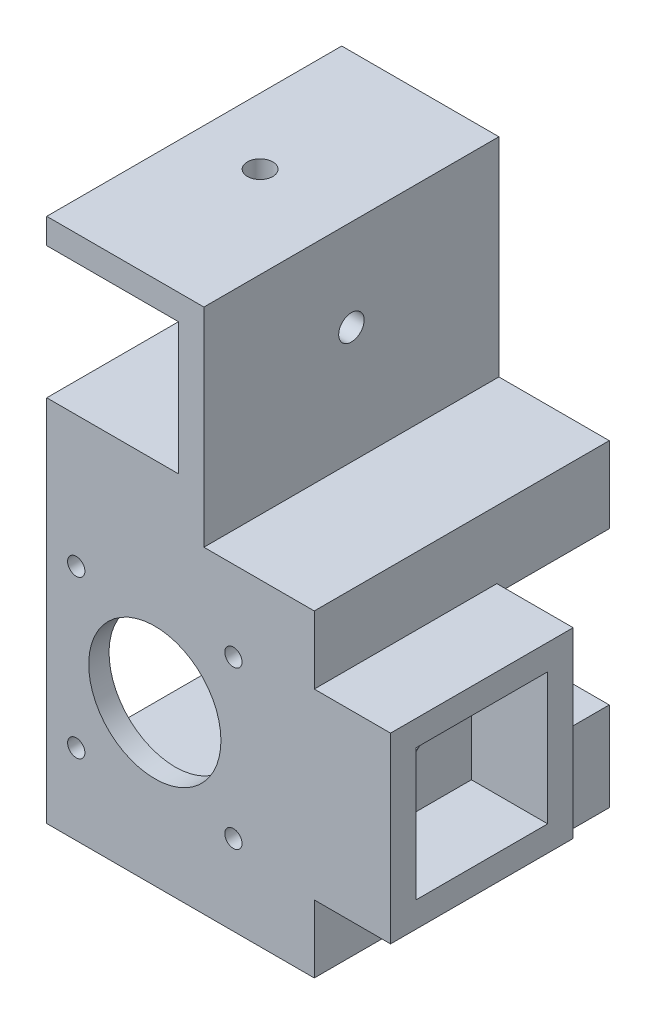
ISO-10303-21;
HEADER;
FILE_DESCRIPTION(('STEP AP214'),'2;1');
FILE_NAME('part.step','',(''),(''),'','','');
FILE_SCHEMA(('AUTOMOTIVE_DESIGN { 1 0 10303 214 1 1 1 1 }'));
ENDSEC;
DATA;
#1=APPLICATION_CONTEXT('core data for automotive mechanical design processes');
#2=APPLICATION_PROTOCOL_DEFINITION('international standard','automotive_design',2000,#1);
#3=PRODUCT_CONTEXT('',#1,'mechanical');
#4=PRODUCT('Part','Part','',(#3));
#5=PRODUCT_RELATED_PRODUCT_CATEGORY('part','',(#4));
#6=PRODUCT_DEFINITION_FORMATION('','',#4);
#7=PRODUCT_DEFINITION_CONTEXT('part definition',#1,'design');
#8=PRODUCT_DEFINITION('design','',#6,#7);
#9=PRODUCT_DEFINITION_SHAPE('','',#8);
#10=(LENGTH_UNIT() NAMED_UNIT(*) SI_UNIT(.MILLI.,.METRE.));
#11=(NAMED_UNIT(*) PLANE_ANGLE_UNIT() SI_UNIT($,.RADIAN.));
#12=(NAMED_UNIT(*) SI_UNIT($,.STERADIAN.) SOLID_ANGLE_UNIT());
#13=UNCERTAINTY_MEASURE_WITH_UNIT(LENGTH_MEASURE(1.E-05),#10,'distance_accuracy_value','');
#14=(GEOMETRIC_REPRESENTATION_CONTEXT(3) GLOBAL_UNCERTAINTY_ASSIGNED_CONTEXT((#13)) GLOBAL_UNIT_ASSIGNED_CONTEXT((#10,
#11,#12)) REPRESENTATION_CONTEXT('',''));
#15=CARTESIAN_POINT('',(0.,0.,0.));
#16=DIRECTION('',(0.,0.,1.));
#17=DIRECTION('',(1.,0.,0.));
#18=AXIS2_PLACEMENT_3D('',#15,#16,#17);
#19=CARTESIAN_POINT('',(31.35,0.,0.));
#20=DIRECTION('',(-1.,0.,0.));
#21=DIRECTION('',(0.,0.,1.));
#22=AXIS2_PLACEMENT_3D('',#19,#20,#21);
#23=PLANE('',#22);
#24=DIRECTION('',(0.,1.,0.));
#25=VECTOR('',#24,1.);
#26=CARTESIAN_POINT('',(31.35,-17.95,-25.9));
#27=LINE('',#26,#25);
#28=CARTESIAN_POINT('',(31.35,16.25,-25.9));
#29=VERTEX_POINT('',#28);
#30=CARTESIAN_POINT('',(31.35,17.95,-25.9));
#31=VERTEX_POINT('',#30);
#32=EDGE_CURVE('E396',#29,#31,#27,.T.);
#33=ORIENTED_EDGE('',*,*,#32,.F.);
#34=DIRECTION('',(0.,0.,1.));
#35=VECTOR('',#34,1.);
#36=CARTESIAN_POINT('',(31.35,16.25,-25.9));
#37=LINE('',#36,#35);
#38=CARTESIAN_POINT('',(31.35,16.25,-48.));
#39=VERTEX_POINT('',#38);
#40=EDGE_CURVE('E315',#39,#29,#37,.T.);
#41=ORIENTED_EDGE('',*,*,#40,.F.);
#42=DIRECTION('',(0.,1.,0.));
#43=VECTOR('',#42,1.);
#44=CARTESIAN_POINT('',(31.35,-31.25,-48.));
#45=LINE('',#44,#43);
#46=CARTESIAN_POINT('',(31.35,31.25,-48.));
#47=VERTEX_POINT('',#46);
#48=EDGE_CURVE('E414',#39,#47,#45,.T.);
#49=ORIENTED_EDGE('',*,*,#48,.T.);
#50=DIRECTION('',(0.,0.,1.));
#51=VECTOR('',#50,1.);
#52=CARTESIAN_POINT('',(31.35,31.25,9.99999999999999));
#53=LINE('',#52,#51);
#54=CARTESIAN_POINT('',(31.35,31.25,9.99999999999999));
#55=VERTEX_POINT('',#54);
#56=EDGE_CURVE('E418',#47,#55,#53,.T.);
#57=ORIENTED_EDGE('',*,*,#56,.T.);
#58=DIRECTION('',(0.,-1.,0.));
#59=VECTOR('',#58,1.);
#60=CARTESIAN_POINT('',(31.35,-31.25,9.99999999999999));
#61=LINE('',#60,#59);
#62=CARTESIAN_POINT('',(31.35,17.95,9.99999999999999));
#63=VERTEX_POINT('',#62);
#64=EDGE_CURVE('E422',#55,#63,#61,.T.);
#65=ORIENTED_EDGE('',*,*,#64,.T.);
#66=DIRECTION('',(0.,0.,1.));
#67=VECTOR('',#66,1.);
#68=CARTESIAN_POINT('',(31.35,17.95,9.99999999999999));
#69=LINE('',#68,#67);
#70=EDGE_CURVE('E400',#31,#63,#69,.T.);
#71=ORIENTED_EDGE('',*,*,#70,.F.);
#72=EDGE_LOOP('',(#33,#41,#49,#57,#65,#71));
#73=FACE_BOUND('',#72,.T.);
#74=ADVANCED_FACE('F41',(#73),#23,.F.);
#75=CARTESIAN_POINT('',(0.,0.,-48.));
#76=DIRECTION('',(0.,0.,-1.));
#77=DIRECTION('',(-1.,0.,0.));
#78=AXIS2_PLACEMENT_3D('',#75,#76,#77);
#79=PLANE('',#78);
#80=DIRECTION('',(1.,0.,0.));
#81=VECTOR('',#80,1.);
#82=CARTESIAN_POINT('',(9.65,72.15,-48.));
#83=LINE('',#82,#81);
#84=CARTESIAN_POINT('',(-21.25,72.15,-48.));
#85=VERTEX_POINT('',#84);
#86=CARTESIAN_POINT('',(9.65,72.15,-48.));
#87=VERTEX_POINT('',#86);
#88=EDGE_CURVE('E293',#85,#87,#83,.T.);
#89=ORIENTED_EDGE('',*,*,#88,.T.);
#90=DIRECTION('',(0.,-1.,0.));
#91=VECTOR('',#90,1.);
#92=CARTESIAN_POINT('',(9.64999999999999,77.15,-48.));
#93=LINE('',#92,#91);
#94=CARTESIAN_POINT('',(9.64999999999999,31.25,-48.));
#95=VERTEX_POINT('',#94);
#96=EDGE_CURVE('E350',#87,#95,#93,.T.);
#97=ORIENTED_EDGE('',*,*,#96,.T.);
#98=DIRECTION('',(-1.,0.,0.));
#99=VECTOR('',#98,1.);
#100=CARTESIAN_POINT('',(-31.25,31.25,-48.));
#101=LINE('',#100,#99);
#102=EDGE_CURVE('E226',#47,#95,#101,.T.);
#103=ORIENTED_EDGE('',*,*,#102,.F.);
#104=ORIENTED_EDGE('',*,*,#48,.F.);
#105=DIRECTION('',(1.,0.,0.));
#106=VECTOR('',#105,1.);
#107=CARTESIAN_POINT('',(-31.25,16.25,-48.));
#108=LINE('',#107,#106);
#109=CARTESIAN_POINT('',(21.25,16.25,-48.));
#110=VERTEX_POINT('',#109);
#111=EDGE_CURVE('E322',#110,#39,#108,.T.);
#112=ORIENTED_EDGE('',*,*,#111,.F.);
#113=DIRECTION('',(0.,1.,0.));
#114=VECTOR('',#113,1.);
#115=CARTESIAN_POINT('',(21.25,-21.25,-48.));
#116=LINE('',#115,#114);
#117=CARTESIAN_POINT('',(21.25,21.25,-48.));
#118=VERTEX_POINT('',#117);
#119=EDGE_CURVE('E436',#110,#118,#116,.T.);
#120=ORIENTED_EDGE('',*,*,#119,.T.);
#121=DIRECTION('',(-1.,0.,0.));
#122=VECTOR('',#121,1.);
#123=CARTESIAN_POINT('',(-21.25,21.25,-48.));
#124=LINE('',#123,#122);
#125=CARTESIAN_POINT('',(-21.25,21.25,-48.));
#126=VERTEX_POINT('',#125);
#127=EDGE_CURVE('E438',#118,#126,#124,.T.);
#128=ORIENTED_EDGE('',*,*,#127,.T.);
#129=DIRECTION('',(0.,1.,0.));
#130=VECTOR('',#129,1.);
#131=CARTESIAN_POINT('',(-21.25,72.15,-48.));
#132=LINE('',#131,#130);
#133=CARTESIAN_POINT('',(-21.25,41.25,-48.));
#134=VERTEX_POINT('',#133);
#135=EDGE_CURVE('E301',#126,#134,#132,.T.);
#136=ORIENTED_EDGE('',*,*,#135,.T.);
#137=DIRECTION('',(1.,0.,0.));
#138=VECTOR('',#137,1.);
#139=CARTESIAN_POINT('',(4.65,41.25,-48.));
#140=LINE('',#139,#138);
#141=CARTESIAN_POINT('',(4.65,41.25,-48.));
#142=VERTEX_POINT('',#141);
#143=EDGE_CURVE('E310',#134,#142,#140,.T.);
#144=ORIENTED_EDGE('',*,*,#143,.T.);
#145=DIRECTION('',(0.,1.,0.));
#146=VECTOR('',#145,1.);
#147=CARTESIAN_POINT('',(4.65,67.15,-48.));
#148=LINE('',#147,#146);
#149=CARTESIAN_POINT('',(4.65,67.15,-48.));
#150=VERTEX_POINT('',#149);
#151=EDGE_CURVE('E304',#142,#150,#148,.T.);
#152=ORIENTED_EDGE('',*,*,#151,.T.);
#153=DIRECTION('',(-1.,0.,0.));
#154=VECTOR('',#153,1.);
#155=CARTESIAN_POINT('',(4.65,67.15,-48.));
#156=LINE('',#155,#154);
#157=CARTESIAN_POINT('',(-21.25,67.15,-48.));
#158=VERTEX_POINT('',#157);
#159=EDGE_CURVE('E307',#150,#158,#156,.T.);
#160=ORIENTED_EDGE('',*,*,#159,.T.);
#161=EDGE_CURVE('E296',#158,#85,#132,.T.);
#162=ORIENTED_EDGE('',*,*,#161,.T.);
#163=EDGE_LOOP('',(#89,#97,#103,#104,#112,#120,#128,#136,#144,#152,#160,#162));
#164=FACE_BOUND('',#163,.T.);
#165=ADVANCED_FACE('F480',(#164),#79,.T.);
#166=CARTESIAN_POINT('',(21.35,0.,-7.95000000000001));
#167=DIRECTION('',(1.,0.,0.));
#168=DIRECTION('',(0.,0.,-1.));
#169=AXIS2_PLACEMENT_3D('',#166,#167,#168);
#170=CYLINDRICAL_SURFACE('',#169,3.43);
#171=CARTESIAN_POINT('',(31.35,0.,-7.95000000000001));
#172=DIRECTION('',(1.,0.,0.));
#173=DIRECTION('',(0.,0.,-1.));
#174=AXIS2_PLACEMENT_3D('',#171,#172,#173);
#175=CIRCLE('',#174,3.43);
#176=CARTESIAN_POINT('',(31.35,0.,-11.38));
#177=VERTEX_POINT('',#176);
#178=EDGE_CURVE('E373',#177,#177,#175,.T.);
#179=ORIENTED_EDGE('',*,*,#178,.T.);
#180=EDGE_LOOP('',(#179));
#181=FACE_BOUND('',#180,.T.);
#182=CARTESIAN_POINT('',(31.25,0.,-7.95000000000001));
#183=DIRECTION('',(-1.,0.,0.));
#184=DIRECTION('',(0.,0.,1.));
#185=AXIS2_PLACEMENT_3D('',#182,#183,#184);
#186=CIRCLE('',#185,3.43);
#187=CARTESIAN_POINT('',(31.25,0.,-4.52));
#188=VERTEX_POINT('',#187);
#189=EDGE_CURVE('E370',#188,#188,#186,.F.);
#190=ORIENTED_EDGE('',*,*,#189,.F.);
#191=EDGE_LOOP('',(#190));
#192=FACE_BOUND('',#191,.T.);
#193=ADVANCED_FACE('F490',(#181,#192),#170,.F.);
#194=CARTESIAN_POINT('',(31.35,-31.25,-48.));
#195=VERTEX_POINT('',#194);
#196=CARTESIAN_POINT('',(31.35,-13.75,-48.));
#197=VERTEX_POINT('',#196);
#198=EDGE_CURVE('E415',#195,#197,#45,.T.);
#199=ORIENTED_EDGE('',*,*,#198,.T.);
#200=DIRECTION('',(0.,0.,-1.));
#201=VECTOR('',#200,1.);
#202=CARTESIAN_POINT('',(31.35,-13.75,-25.9));
#203=LINE('',#202,#201);
#204=CARTESIAN_POINT('',(31.35,-13.75,-25.9));
#205=VERTEX_POINT('',#204);
#206=EDGE_CURVE('E313',#205,#197,#203,.T.);
#207=ORIENTED_EDGE('',*,*,#206,.F.);
#208=CARTESIAN_POINT('',(31.35,-17.95,-25.9));
#209=VERTEX_POINT('',#208);
#210=EDGE_CURVE('E397',#209,#205,#27,.T.);
#211=ORIENTED_EDGE('',*,*,#210,.F.);
#212=DIRECTION('',(0.,0.,-1.));
#213=VECTOR('',#212,1.);
#214=CARTESIAN_POINT('',(31.35,-17.95,9.99999999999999));
#215=LINE('',#214,#213);
#216=CARTESIAN_POINT('',(31.35,-17.95,9.99999999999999));
#217=VERTEX_POINT('',#216);
#218=EDGE_CURVE('E403',#217,#209,#215,.T.);
#219=ORIENTED_EDGE('',*,*,#218,.F.);
#220=CARTESIAN_POINT('',(31.35,-31.25,9.99999999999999));
#221=VERTEX_POINT('',#220);
#222=EDGE_CURVE('E421',#217,#221,#61,.T.);
#223=ORIENTED_EDGE('',*,*,#222,.T.);
#224=DIRECTION('',(0.,0.,-1.));
#225=VECTOR('',#224,1.);
#226=CARTESIAN_POINT('',(31.35,-31.25,9.99999999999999));
#227=LINE('',#226,#225);
#228=EDGE_CURVE('E425',#221,#195,#227,.T.);
#229=ORIENTED_EDGE('',*,*,#228,.T.);
#230=EDGE_LOOP('',(#199,#207,#211,#219,#223,#229));
#231=FACE_BOUND('',#230,.T.);
#232=ADVANCED_FACE('F483',(#231),#23,.F.);
#233=CARTESIAN_POINT('',(-31.25,-31.25,-48.));
#234=DIRECTION('',(0.,-1.,0.));
#235=DIRECTION('',(0.,0.,-1.));
#236=AXIS2_PLACEMENT_3D('',#233,#234,#235);
#237=PLANE('',#236);
#238=DIRECTION('',(0.,0.,1.));
#239=VECTOR('',#238,1.);
#240=CARTESIAN_POINT('',(-21.25,-31.25,-48.));
#241=LINE('',#240,#239);
#242=CARTESIAN_POINT('',(-21.25,-31.25,-48.));
#243=VERTEX_POINT('',#242);
#244=CARTESIAN_POINT('',(-21.25,-31.25,10.));
#245=VERTEX_POINT('',#244);
#246=EDGE_CURVE('E300',#243,#245,#241,.T.);
#247=ORIENTED_EDGE('',*,*,#246,.F.);
#248=DIRECTION('',(1.,0.,0.));
#249=VECTOR('',#248,1.);
#250=CARTESIAN_POINT('',(-31.25,-31.25,-48.));
#251=LINE('',#250,#249);
#252=EDGE_CURVE('E450',#243,#195,#251,.T.);
#253=ORIENTED_EDGE('',*,*,#252,.T.);
#254=ORIENTED_EDGE('',*,*,#228,.F.);
#255=DIRECTION('',(1.,0.,0.));
#256=VECTOR('',#255,1.);
#257=CARTESIAN_POINT('',(-31.25,-31.25,10.));
#258=LINE('',#257,#256);
#259=EDGE_CURVE('E434',#245,#221,#258,.T.);
#260=ORIENTED_EDGE('',*,*,#259,.F.);
#261=EDGE_LOOP('',(#247,#253,#254,#260));
#262=FACE_BOUND('',#261,.T.);
#263=ADVANCED_FACE('F497',(#262),#237,.T.);
#264=CARTESIAN_POINT('',(-31.25,31.25,-48.));
#265=DIRECTION('',(0.,1.,0.));
#266=DIRECTION('',(0.,0.,1.));
#267=AXIS2_PLACEMENT_3D('',#264,#265,#266);
#268=PLANE('',#267);
#269=DIRECTION('',(0.,0.,-1.));
#270=VECTOR('',#269,1.);
#271=CARTESIAN_POINT('',(9.64999999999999,31.25,-48.));
#272=LINE('',#271,#270);
#273=CARTESIAN_POINT('',(9.64999999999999,31.25,10.));
#274=VERTEX_POINT('',#273);
#275=EDGE_CURVE('E347',#274,#95,#272,.T.);
#276=ORIENTED_EDGE('',*,*,#275,.F.);
#277=DIRECTION('',(-1.,0.,0.));
#278=VECTOR('',#277,1.);
#279=CARTESIAN_POINT('',(-31.25,31.25,10.));
#280=LINE('',#279,#278);
#281=EDGE_CURVE('E431',#55,#274,#280,.T.);
#282=ORIENTED_EDGE('',*,*,#281,.F.);
#283=ORIENTED_EDGE('',*,*,#56,.F.);
#284=ORIENTED_EDGE('',*,*,#102,.T.);
#285=EDGE_LOOP('',(#276,#282,#283,#284));
#286=FACE_BOUND('',#285,.T.);
#287=ADVANCED_FACE('F43',(#286),#268,.T.);
#288=CARTESIAN_POINT('',(-21.25,-21.25,-48.));
#289=VERTEX_POINT('',#288);
#290=EDGE_CURVE('E297',#243,#289,#132,.T.);
#291=ORIENTED_EDGE('',*,*,#290,.T.);
#292=DIRECTION('',(1.,0.,0.));
#293=VECTOR('',#292,1.);
#294=CARTESIAN_POINT('',(-21.25,-21.25,-48.));
#295=LINE('',#294,#293);
#296=CARTESIAN_POINT('',(21.25,-21.25,-48.));
#297=VERTEX_POINT('',#296);
#298=EDGE_CURVE('E441',#289,#297,#295,.T.);
#299=ORIENTED_EDGE('',*,*,#298,.T.);
#300=CARTESIAN_POINT('',(21.25,-13.75,-48.));
#301=VERTEX_POINT('',#300);
#302=EDGE_CURVE('E222',#297,#301,#116,.T.);
#303=ORIENTED_EDGE('',*,*,#302,.T.);
#304=DIRECTION('',(1.,0.,0.));
#305=VECTOR('',#304,1.);
#306=CARTESIAN_POINT('',(-31.25,-13.75,-48.));
#307=LINE('',#306,#305);
#308=EDGE_CURVE('E324',#301,#197,#307,.T.);
#309=ORIENTED_EDGE('',*,*,#308,.T.);
#310=ORIENTED_EDGE('',*,*,#198,.F.);
#311=ORIENTED_EDGE('',*,*,#252,.F.);
#312=EDGE_LOOP('',(#291,#299,#303,#309,#310,#311));
#313=FACE_BOUND('',#312,.T.);
#314=ADVANCED_FACE('F493',(#313),#79,.T.);
#315=CARTESIAN_POINT('',(21.25,-21.25,-48.));
#316=DIRECTION('',(1.,0.,0.));
#317=DIRECTION('',(0.,0.,-1.));
#318=AXIS2_PLACEMENT_3D('',#315,#316,#317);
#319=PLANE('',#318);
#320=CARTESIAN_POINT('',(21.25,0.,-7.95000000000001));
#321=DIRECTION('',(-1.,0.,0.));
#322=DIRECTION('',(0.,0.,1.));
#323=AXIS2_PLACEMENT_3D('',#320,#321,#322);
#324=CIRCLE('',#323,7.);
#325=CARTESIAN_POINT('',(21.25,0.,-0.950000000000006));
#326=VERTEX_POINT('',#325);
#327=EDGE_CURVE('E366',#326,#326,#324,.T.);
#328=ORIENTED_EDGE('',*,*,#327,.F.);
#329=EDGE_LOOP('',(#328));
#330=FACE_BOUND('',#329,.T.);
#331=ORIENTED_EDGE('',*,*,#119,.F.);
#332=DIRECTION('',(0.,0.,1.));
#333=VECTOR('',#332,1.);
#334=CARTESIAN_POINT('',(21.25,16.25,-48.));
#335=LINE('',#334,#333);
#336=CARTESIAN_POINT('',(21.25,16.25,-25.9));
#337=VERTEX_POINT('',#336);
#338=EDGE_CURVE('E329',#110,#337,#335,.T.);
#339=ORIENTED_EDGE('',*,*,#338,.T.);
#340=DIRECTION('',(0.,-1.,0.));
#341=VECTOR('',#340,1.);
#342=CARTESIAN_POINT('',(21.25,-21.25,-25.9));
#343=LINE('',#342,#341);
#344=CARTESIAN_POINT('',(21.25,-13.75,-25.9));
#345=VERTEX_POINT('',#344);
#346=EDGE_CURVE('E332',#337,#345,#343,.T.);
#347=ORIENTED_EDGE('',*,*,#346,.T.);
#348=DIRECTION('',(0.,0.,-1.));
#349=VECTOR('',#348,1.);
#350=CARTESIAN_POINT('',(21.25,-13.75,-48.));
#351=LINE('',#350,#349);
#352=EDGE_CURVE('E321',#345,#301,#351,.T.);
#353=ORIENTED_EDGE('',*,*,#352,.T.);
#354=ORIENTED_EDGE('',*,*,#302,.F.);
#355=DIRECTION('',(0.,0.,1.));
#356=VECTOR('',#355,1.);
#357=CARTESIAN_POINT('',(21.25,-21.25,-48.));
#358=LINE('',#357,#356);
#359=CARTESIAN_POINT('',(21.25,-21.25,6.00000000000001));
#360=VERTEX_POINT('',#359);
#361=EDGE_CURVE('E213',#297,#360,#358,.T.);
#362=ORIENTED_EDGE('',*,*,#361,.T.);
#363=DIRECTION('',(0.,1.,0.));
#364=VECTOR('',#363,1.);
#365=CARTESIAN_POINT('',(21.25,21.25,6.));
#366=LINE('',#365,#364);
#367=CARTESIAN_POINT('',(21.25,21.25,6.));
#368=VERTEX_POINT('',#367);
#369=EDGE_CURVE('E219',#360,#368,#366,.T.);
#370=ORIENTED_EDGE('',*,*,#369,.T.);
#371=DIRECTION('',(0.,0.,1.));
#372=VECTOR('',#371,1.);
#373=CARTESIAN_POINT('',(21.25,21.25,-48.));
#374=LINE('',#373,#372);
#375=EDGE_CURVE('E442',#118,#368,#374,.T.);
#376=ORIENTED_EDGE('',*,*,#375,.F.);
#377=EDGE_LOOP('',(#331,#339,#347,#353,#354,#362,#370,#376));
#378=FACE_BOUND('',#377,.T.);
#379=ADVANCED_FACE('F216',(#330,#378),#319,.F.);
#380=CARTESIAN_POINT('',(-21.25,-21.25,-48.));
#381=DIRECTION('',(0.,-1.,0.));
#382=DIRECTION('',(0.,0.,-1.));
#383=AXIS2_PLACEMENT_3D('',#380,#381,#382);
#384=PLANE('',#383);
#385=DIRECTION('',(0.,0.,1.));
#386=VECTOR('',#385,1.);
#387=CARTESIAN_POINT('',(-21.25,-21.25,-48.));
#388=LINE('',#387,#386);
#389=CARTESIAN_POINT('',(-21.25,-21.25,6.00000000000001));
#390=VERTEX_POINT('',#389);
#391=EDGE_CURVE('E227',#289,#390,#388,.T.);
#392=ORIENTED_EDGE('',*,*,#391,.T.);
#393=DIRECTION('',(-1.,0.,0.));
#394=VECTOR('',#393,1.);
#395=CARTESIAN_POINT('',(21.25,-21.25,6.00000000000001));
#396=LINE('',#395,#394);
#397=EDGE_CURVE('E230',#360,#390,#396,.T.);
#398=ORIENTED_EDGE('',*,*,#397,.F.);
#399=ORIENTED_EDGE('',*,*,#361,.F.);
#400=ORIENTED_EDGE('',*,*,#298,.F.);
#401=EDGE_LOOP('',(#392,#398,#399,#400));
#402=FACE_BOUND('',#401,.T.);
#403=ADVANCED_FACE('F231',(#402),#384,.F.);
#404=CARTESIAN_POINT('',(-21.25,21.25,-48.));
#405=DIRECTION('',(0.,1.,0.));
#406=DIRECTION('',(0.,0.,1.));
#407=AXIS2_PLACEMENT_3D('',#404,#405,#406);
#408=PLANE('',#407);
#409=ORIENTED_EDGE('',*,*,#375,.T.);
#410=DIRECTION('',(-1.,0.,0.));
#411=VECTOR('',#410,1.);
#412=CARTESIAN_POINT('',(21.25,21.25,6.));
#413=LINE('',#412,#411);
#414=CARTESIAN_POINT('',(-21.25,21.25,6.));
#415=VERTEX_POINT('',#414);
#416=EDGE_CURVE('E235',#368,#415,#413,.T.);
#417=ORIENTED_EDGE('',*,*,#416,.T.);
#418=DIRECTION('',(0.,0.,1.));
#419=VECTOR('',#418,1.);
#420=CARTESIAN_POINT('',(-21.25,21.25,-48.));
#421=LINE('',#420,#419);
#422=EDGE_CURVE('E445',#126,#415,#421,.T.);
#423=ORIENTED_EDGE('',*,*,#422,.F.);
#424=ORIENTED_EDGE('',*,*,#127,.F.);
#425=EDGE_LOOP('',(#409,#417,#423,#424));
#426=FACE_BOUND('',#425,.T.);
#427=ADVANCED_FACE('F598',(#426),#408,.F.);
#428=CARTESIAN_POINT('',(0.,0.,10.));
#429=DIRECTION('',(0.,0.,-1.));
#430=DIRECTION('',(-1.,0.,0.));
#431=AXIS2_PLACEMENT_3D('',#428,#429,#430);
#432=PLANE('',#431);
#433=CARTESIAN_POINT('',(0.,0.,10.));
#434=DIRECTION('',(0.,0.,1.));
#435=DIRECTION('',(1.,0.,0.));
#436=AXIS2_PLACEMENT_3D('',#433,#434,#435);
#437=CIRCLE('',#436,13.);
#438=CARTESIAN_POINT('',(13.,0.,10.));
#439=VERTEX_POINT('',#438);
#440=EDGE_CURVE('E428',#439,#439,#437,.T.);
#441=ORIENTED_EDGE('',*,*,#440,.F.);
#442=EDGE_LOOP('',(#441));
#443=FACE_BOUND('',#442,.T.);
#444=CARTESIAN_POINT('',(15.45,-15.45,10.));
#445=DIRECTION('',(0.,0.,1.));
#446=DIRECTION('',(1.,0.,0.));
#447=AXIS2_PLACEMENT_3D('',#444,#445,#446);
#448=CIRCLE('',#447,1.7);
#449=CARTESIAN_POINT('',(17.15,-15.45,10.));
#450=VERTEX_POINT('',#449);
#451=EDGE_CURVE('E359',#450,#450,#448,.T.);
#452=ORIENTED_EDGE('',*,*,#451,.F.);
#453=EDGE_LOOP('',(#452));
#454=FACE_BOUND('',#453,.T.);
#455=CARTESIAN_POINT('',(15.45,15.45,10.));
#456=DIRECTION('',(0.,0.,1.));
#457=DIRECTION('',(1.,0.,0.));
#458=AXIS2_PLACEMENT_3D('',#455,#456,#457);
#459=CIRCLE('',#458,1.7);
#460=CARTESIAN_POINT('',(17.15,15.45,10.));
#461=VERTEX_POINT('',#460);
#462=EDGE_CURVE('E355',#461,#461,#459,.T.);
#463=ORIENTED_EDGE('',*,*,#462,.F.);
#464=EDGE_LOOP('',(#463));
#465=FACE_BOUND('',#464,.T.);
#466=DIRECTION('',(-1.,0.,0.));
#467=VECTOR('',#466,1.);
#468=CARTESIAN_POINT('',(51.35,-17.95,9.99999999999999));
#469=LINE('',#468,#467);
#470=CARTESIAN_POINT('',(46.35,-17.95,9.99999999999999));
#471=VERTEX_POINT('',#470);
#472=EDGE_CURVE('E408',#471,#217,#469,.T.);
#473=ORIENTED_EDGE('',*,*,#472,.F.);
#474=DIRECTION('',(0.,1.,0.));
#475=VECTOR('',#474,1.);
#476=CARTESIAN_POINT('',(46.35,-31.25,9.99999999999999));
#477=LINE('',#476,#475);
#478=CARTESIAN_POINT('',(46.35,17.95,9.99999999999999));
#479=VERTEX_POINT('',#478);
#480=EDGE_CURVE('E56',#471,#479,#477,.T.);
#481=ORIENTED_EDGE('',*,*,#480,.T.);
#482=DIRECTION('',(-1.,0.,0.));
#483=VECTOR('',#482,1.);
#484=CARTESIAN_POINT('',(51.35,17.95,9.99999999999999));
#485=LINE('',#484,#483);
#486=EDGE_CURVE('E410',#479,#63,#485,.T.);
#487=ORIENTED_EDGE('',*,*,#486,.T.);
#488=ORIENTED_EDGE('',*,*,#64,.F.);
#489=ORIENTED_EDGE('',*,*,#281,.T.);
#490=DIRECTION('',(0.,-1.,0.));
#491=VECTOR('',#490,1.);
#492=CARTESIAN_POINT('',(9.65,77.15,9.99999999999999));
#493=LINE('',#492,#491);
#494=CARTESIAN_POINT('',(9.65,72.15,9.99999999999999));
#495=VERTEX_POINT('',#494);
#496=EDGE_CURVE('E352',#495,#274,#493,.T.);
#497=ORIENTED_EDGE('',*,*,#496,.F.);
#498=DIRECTION('',(-1.,0.,0.));
#499=VECTOR('',#498,1.);
#500=CARTESIAN_POINT('',(-21.25,72.15,9.99999999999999));
#501=LINE('',#500,#499);
#502=CARTESIAN_POINT('',(-21.25,72.15,9.99999999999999));
#503=VERTEX_POINT('',#502);
#504=EDGE_CURVE('E281',#495,#503,#501,.T.);
#505=ORIENTED_EDGE('',*,*,#504,.T.);
#506=DIRECTION('',(0.,1.,0.));
#507=VECTOR('',#506,1.);
#508=CARTESIAN_POINT('',(-21.25,-31.25,9.99999999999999));
#509=LINE('',#508,#507);
#510=CARTESIAN_POINT('',(-21.25,67.15,9.99999999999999));
#511=VERTEX_POINT('',#510);
#512=EDGE_CURVE('E283',#511,#503,#509,.T.);
#513=ORIENTED_EDGE('',*,*,#512,.F.);
#514=DIRECTION('',(-1.,0.,0.));
#515=VECTOR('',#514,1.);
#516=CARTESIAN_POINT('',(0.,67.15,9.99999999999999));
#517=LINE('',#516,#515);
#518=CARTESIAN_POINT('',(4.65,67.15,9.99999999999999));
#519=VERTEX_POINT('',#518);
#520=EDGE_CURVE('E286',#519,#511,#517,.T.);
#521=ORIENTED_EDGE('',*,*,#520,.F.);
#522=DIRECTION('',(0.,1.,0.));
#523=VECTOR('',#522,1.);
#524=CARTESIAN_POINT('',(4.65,0.,9.99999999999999));
#525=LINE('',#524,#523);
#526=CARTESIAN_POINT('',(4.65,41.25,9.99999999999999));
#527=VERTEX_POINT('',#526);
#528=EDGE_CURVE('E49',#527,#519,#525,.T.);
#529=ORIENTED_EDGE('',*,*,#528,.F.);
#530=DIRECTION('',(-1.,0.,0.));
#531=VECTOR('',#530,1.);
#532=CARTESIAN_POINT('',(0.,41.25,9.99999999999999));
#533=LINE('',#532,#531);
#534=CARTESIAN_POINT('',(-21.25,41.25,9.99999999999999));
#535=VERTEX_POINT('',#534);
#536=EDGE_CURVE('E289',#527,#535,#533,.T.);
#537=ORIENTED_EDGE('',*,*,#536,.T.);
#538=DIRECTION('',(0.,1.,0.));
#539=VECTOR('',#538,1.);
#540=CARTESIAN_POINT('',(-21.25,72.15,10.));
#541=LINE('',#540,#539);
#542=EDGE_CURVE('E292',#245,#535,#541,.T.);
#543=ORIENTED_EDGE('',*,*,#542,.F.);
#544=ORIENTED_EDGE('',*,*,#259,.T.);
#545=ORIENTED_EDGE('',*,*,#222,.F.);
#546=EDGE_LOOP('',(#473,#481,#487,#488,#489,#497,#505,#513,#521,#529,#537,#543,#544,#545));
#547=FACE_BOUND('',#546,.T.);
#548=CARTESIAN_POINT('',(-15.45,15.45,10.));
#549=DIRECTION('',(0.,0.,1.));
#550=DIRECTION('',(1.,0.,0.));
#551=AXIS2_PLACEMENT_3D('',#548,#549,#550);
#552=CIRCLE('',#551,1.7);
#553=CARTESIAN_POINT('',(-13.75,15.45,10.));
#554=VERTEX_POINT('',#553);
#555=EDGE_CURVE('E358',#554,#554,#552,.T.);
#556=ORIENTED_EDGE('',*,*,#555,.F.);
#557=EDGE_LOOP('',(#556));
#558=FACE_BOUND('',#557,.T.);
#559=CARTESIAN_POINT('',(-15.45,-15.45,10.));
#560=DIRECTION('',(0.,0.,1.));
#561=DIRECTION('',(1.,0.,0.));
#562=AXIS2_PLACEMENT_3D('',#559,#560,#561);
#563=CIRCLE('',#562,1.7);
#564=CARTESIAN_POINT('',(-13.75,-15.45,10.));
#565=VERTEX_POINT('',#564);
#566=EDGE_CURVE('E354',#565,#565,#563,.T.);
#567=ORIENTED_EDGE('',*,*,#566,.F.);
#568=EDGE_LOOP('',(#567));
#569=FACE_BOUND('',#568,.T.);
#570=ADVANCED_FACE('F548',(#443,#454,#465,#547,#558,#569),#432,.F.);
#571=CARTESIAN_POINT('',(0.,0.,10.));
#572=DIRECTION('',(0.,0.,-1.));
#573=DIRECTION('',(-1.,0.,0.));
#574=AXIS2_PLACEMENT_3D('',#571,#572,#573);
#575=CYLINDRICAL_SURFACE('',#574,13.);
#576=CARTESIAN_POINT('',(0.,0.,6.));
#577=DIRECTION('',(0.,0.,1.));
#578=DIRECTION('',(0.,-1.,0.));
#579=AXIS2_PLACEMENT_3D('',#576,#577,#578);
#580=CIRCLE('',#579,13.);
#581=CARTESIAN_POINT('',(0.,-13.,6.));
#582=VERTEX_POINT('',#581);
#583=EDGE_CURVE('E258',#582,#582,#580,.T.);
#584=ORIENTED_EDGE('',*,*,#583,.F.);
#585=EDGE_LOOP('',(#584));
#586=FACE_BOUND('',#585,.T.);
#587=ORIENTED_EDGE('',*,*,#440,.T.);
#588=EDGE_LOOP('',(#587));
#589=FACE_BOUND('',#588,.T.);
#590=ADVANCED_FACE('F618',(#586,#589),#575,.F.);
#591=CARTESIAN_POINT('',(51.35,-17.95,-25.9));
#592=DIRECTION('',(0.,0.,1.));
#593=DIRECTION('',(1.,0.,0.));
#594=AXIS2_PLACEMENT_3D('',#591,#592,#593);
#595=PLANE('',#594);
#596=DIRECTION('',(-1.,0.,0.));
#597=VECTOR('',#596,1.);
#598=CARTESIAN_POINT('',(51.35,17.95,-25.9));
#599=LINE('',#598,#597);
#600=CARTESIAN_POINT('',(46.35,17.95,-25.9));
#601=VERTEX_POINT('',#600);
#602=EDGE_CURVE('E412',#601,#31,#599,.T.);
#603=ORIENTED_EDGE('',*,*,#602,.F.);
#604=DIRECTION('',(0.,1.,0.));
#605=VECTOR('',#604,1.);
#606=CARTESIAN_POINT('',(46.35,-31.25,-25.9));
#607=LINE('',#606,#605);
#608=CARTESIAN_POINT('',(46.35,-17.95,-25.9));
#609=VERTEX_POINT('',#608);
#610=EDGE_CURVE('E263',#609,#601,#607,.T.);
#611=ORIENTED_EDGE('',*,*,#610,.F.);
#612=DIRECTION('',(-1.,0.,0.));
#613=VECTOR('',#612,1.);
#614=CARTESIAN_POINT('',(51.35,-17.95,-25.9));
#615=LINE('',#614,#613);
#616=EDGE_CURVE('E406',#609,#209,#615,.T.);
#617=ORIENTED_EDGE('',*,*,#616,.T.);
#618=ORIENTED_EDGE('',*,*,#210,.T.);
#619=DIRECTION('',(1.,0.,0.));
#620=VECTOR('',#619,1.);
#621=CARTESIAN_POINT('',(-31.25,-13.75,-25.9));
#622=LINE('',#621,#620);
#623=EDGE_CURVE('E317',#345,#205,#622,.T.);
#624=ORIENTED_EDGE('',*,*,#623,.F.);
#625=ORIENTED_EDGE('',*,*,#346,.F.);
#626=DIRECTION('',(1.,0.,0.));
#627=VECTOR('',#626,1.);
#628=CARTESIAN_POINT('',(-31.25,16.25,-25.9));
#629=LINE('',#628,#627);
#630=EDGE_CURVE('E318',#337,#29,#629,.T.);
#631=ORIENTED_EDGE('',*,*,#630,.T.);
#632=ORIENTED_EDGE('',*,*,#32,.T.);
#633=EDGE_LOOP('',(#603,#611,#617,#618,#624,#625,#631,#632));
#634=FACE_BOUND('',#633,.T.);
#635=ADVANCED_FACE('F540',(#634),#595,.F.);
#636=CARTESIAN_POINT('',(51.35,17.95,9.99999999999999));
#637=DIRECTION('',(0.,-1.,0.));
#638=DIRECTION('',(0.,0.,-1.));
#639=AXIS2_PLACEMENT_3D('',#636,#637,#638);
#640=PLANE('',#639);
#641=ORIENTED_EDGE('',*,*,#486,.F.);
#642=DIRECTION('',(0.,0.,1.));
#643=VECTOR('',#642,1.);
#644=CARTESIAN_POINT('',(46.35,17.95,9.99999999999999));
#645=LINE('',#644,#643);
#646=EDGE_CURVE('E261',#601,#479,#645,.T.);
#647=ORIENTED_EDGE('',*,*,#646,.F.);
#648=ORIENTED_EDGE('',*,*,#602,.T.);
#649=ORIENTED_EDGE('',*,*,#70,.T.);
#650=EDGE_LOOP('',(#641,#647,#648,#649));
#651=FACE_BOUND('',#650,.T.);
#652=ADVANCED_FACE('F538',(#651),#640,.F.);
#653=CARTESIAN_POINT('',(51.35,-17.95,9.99999999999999));
#654=DIRECTION('',(0.,1.,0.));
#655=DIRECTION('',(0.,0.,1.));
#656=AXIS2_PLACEMENT_3D('',#653,#654,#655);
#657=PLANE('',#656);
#658=ORIENTED_EDGE('',*,*,#616,.F.);
#659=DIRECTION('',(0.,0.,1.));
#660=VECTOR('',#659,1.);
#661=CARTESIAN_POINT('',(46.35,-17.95,9.99999999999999));
#662=LINE('',#661,#660);
#663=EDGE_CURVE('E271',#609,#471,#662,.T.);
#664=ORIENTED_EDGE('',*,*,#663,.T.);
#665=ORIENTED_EDGE('',*,*,#472,.T.);
#666=ORIENTED_EDGE('',*,*,#218,.T.);
#667=EDGE_LOOP('',(#658,#664,#665,#666));
#668=FACE_BOUND('',#667,.T.);
#669=ADVANCED_FACE('F554',(#668),#657,.F.);
#670=CARTESIAN_POINT('',(51.35,-12.95,-20.9));
#671=DIRECTION('',(0.,0.,1.));
#672=DIRECTION('',(1.,0.,0.));
#673=AXIS2_PLACEMENT_3D('',#670,#671,#672);
#674=PLANE('',#673);
#675=DIRECTION('',(0.,-1.,0.));
#676=VECTOR('',#675,1.);
#677=CARTESIAN_POINT('',(46.35,-12.95,-20.9));
#678=LINE('',#677,#676);
#679=CARTESIAN_POINT('',(46.35,12.95,-20.9));
#680=VERTEX_POINT('',#679);
#681=CARTESIAN_POINT('',(46.35,-12.95,-20.9));
#682=VERTEX_POINT('',#681);
#683=EDGE_CURVE('E63',#680,#682,#678,.T.);
#684=ORIENTED_EDGE('',*,*,#683,.F.);
#685=DIRECTION('',(-1.,0.,0.));
#686=VECTOR('',#685,1.);
#687=CARTESIAN_POINT('',(51.35,12.95,-20.9));
#688=LINE('',#687,#686);
#689=CARTESIAN_POINT('',(31.35,12.95,-20.9));
#690=VERTEX_POINT('',#689);
#691=EDGE_CURVE('E394',#680,#690,#688,.T.);
#692=ORIENTED_EDGE('',*,*,#691,.T.);
#693=DIRECTION('',(0.,1.,0.));
#694=VECTOR('',#693,1.);
#695=CARTESIAN_POINT('',(31.35,-12.95,-20.9));
#696=LINE('',#695,#694);
#697=CARTESIAN_POINT('',(31.35,-12.95,-20.9));
#698=VERTEX_POINT('',#697);
#699=EDGE_CURVE('E376',#698,#690,#696,.T.);
#700=ORIENTED_EDGE('',*,*,#699,.F.);
#701=DIRECTION('',(-1.,0.,0.));
#702=VECTOR('',#701,1.);
#703=CARTESIAN_POINT('',(51.35,-12.95,-20.9));
#704=LINE('',#703,#702);
#705=EDGE_CURVE('E388',#682,#698,#704,.T.);
#706=ORIENTED_EDGE('',*,*,#705,.F.);
#707=EDGE_LOOP('',(#684,#692,#700,#706));
#708=FACE_BOUND('',#707,.T.);
#709=ADVANCED_FACE('F526',(#708),#674,.T.);
#710=CARTESIAN_POINT('',(51.35,12.95,5.));
#711=DIRECTION('',(0.,-1.,0.));
#712=DIRECTION('',(0.,0.,-1.));
#713=AXIS2_PLACEMENT_3D('',#710,#711,#712);
#714=PLANE('',#713);
#715=DIRECTION('',(0.,0.,-1.));
#716=VECTOR('',#715,1.);
#717=CARTESIAN_POINT('',(46.35,12.95,5.));
#718=LINE('',#717,#716);
#719=CARTESIAN_POINT('',(46.35,12.95,5.));
#720=VERTEX_POINT('',#719);
#721=EDGE_CURVE('E268',#720,#680,#718,.T.);
#722=ORIENTED_EDGE('',*,*,#721,.F.);
#723=DIRECTION('',(-1.,0.,0.));
#724=VECTOR('',#723,1.);
#725=CARTESIAN_POINT('',(51.35,12.95,5.));
#726=LINE('',#725,#724);
#727=CARTESIAN_POINT('',(31.35,12.95,5.));
#728=VERTEX_POINT('',#727);
#729=EDGE_CURVE('E392',#720,#728,#726,.T.);
#730=ORIENTED_EDGE('',*,*,#729,.T.);
#731=DIRECTION('',(0.,0.,1.));
#732=VECTOR('',#731,1.);
#733=CARTESIAN_POINT('',(31.35,12.95,5.));
#734=LINE('',#733,#732);
#735=EDGE_CURVE('E379',#690,#728,#734,.T.);
#736=ORIENTED_EDGE('',*,*,#735,.F.);
#737=ORIENTED_EDGE('',*,*,#691,.F.);
#738=EDGE_LOOP('',(#722,#730,#736,#737));
#739=FACE_BOUND('',#738,.T.);
#740=ADVANCED_FACE('F530',(#739),#714,.T.);
#741=CARTESIAN_POINT('',(51.35,-12.95,5.));
#742=DIRECTION('',(0.,0.,-1.));
#743=DIRECTION('',(-1.,0.,0.));
#744=AXIS2_PLACEMENT_3D('',#741,#742,#743);
#745=PLANE('',#744);
#746=DIRECTION('',(0.,1.,0.));
#747=VECTOR('',#746,1.);
#748=CARTESIAN_POINT('',(46.35,-12.95,5.));
#749=LINE('',#748,#747);
#750=CARTESIAN_POINT('',(46.35,-12.95,5.));
#751=VERTEX_POINT('',#750);
#752=EDGE_CURVE('E265',#751,#720,#749,.T.);
#753=ORIENTED_EDGE('',*,*,#752,.F.);
#754=DIRECTION('',(-1.,0.,0.));
#755=VECTOR('',#754,1.);
#756=CARTESIAN_POINT('',(51.35,-12.95,5.));
#757=LINE('',#756,#755);
#758=CARTESIAN_POINT('',(31.35,-12.95,5.));
#759=VERTEX_POINT('',#758);
#760=EDGE_CURVE('E390',#751,#759,#757,.T.);
#761=ORIENTED_EDGE('',*,*,#760,.T.);
#762=DIRECTION('',(0.,-1.,0.));
#763=VECTOR('',#762,1.);
#764=CARTESIAN_POINT('',(31.35,-12.95,5.));
#765=LINE('',#764,#763);
#766=EDGE_CURVE('E382',#728,#759,#765,.T.);
#767=ORIENTED_EDGE('',*,*,#766,.F.);
#768=ORIENTED_EDGE('',*,*,#729,.F.);
#769=EDGE_LOOP('',(#753,#761,#767,#768));
#770=FACE_BOUND('',#769,.T.);
#771=ADVANCED_FACE('F511',(#770),#745,.T.);
#772=CARTESIAN_POINT('',(51.35,-12.95,5.));
#773=DIRECTION('',(0.,1.,0.));
#774=DIRECTION('',(0.,0.,1.));
#775=AXIS2_PLACEMENT_3D('',#772,#773,#774);
#776=PLANE('',#775);
#777=DIRECTION('',(0.,0.,1.));
#778=VECTOR('',#777,1.);
#779=CARTESIAN_POINT('',(46.35,-12.95,5.));
#780=LINE('',#779,#778);
#781=EDGE_CURVE('E11',#682,#751,#780,.T.);
#782=ORIENTED_EDGE('',*,*,#781,.F.);
#783=ORIENTED_EDGE('',*,*,#705,.T.);
#784=DIRECTION('',(0.,0.,-1.));
#785=VECTOR('',#784,1.);
#786=CARTESIAN_POINT('',(31.35,-12.95,5.));
#787=LINE('',#786,#785);
#788=EDGE_CURVE('E385',#759,#698,#787,.T.);
#789=ORIENTED_EDGE('',*,*,#788,.F.);
#790=ORIENTED_EDGE('',*,*,#760,.F.);
#791=EDGE_LOOP('',(#782,#783,#789,#790));
#792=FACE_BOUND('',#791,.T.);
#793=ADVANCED_FACE('F501',(#792),#776,.T.);
#794=ORIENTED_EDGE('',*,*,#178,.F.);
#795=EDGE_LOOP('',(#794));
#796=FACE_BOUND('',#795,.T.);
#797=ORIENTED_EDGE('',*,*,#766,.T.);
#798=ORIENTED_EDGE('',*,*,#788,.T.);
#799=ORIENTED_EDGE('',*,*,#699,.T.);
#800=ORIENTED_EDGE('',*,*,#735,.T.);
#801=EDGE_LOOP('',(#797,#798,#799,#800));
#802=FACE_BOUND('',#801,.T.);
#803=ADVANCED_FACE('F484',(#796,#802),#23,.F.);
#804=CARTESIAN_POINT('',(31.25,0.,-7.95000000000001));
#805=DIRECTION('',(-1.,0.,0.));
#806=DIRECTION('',(0.,0.,1.));
#807=AXIS2_PLACEMENT_3D('',#804,#805,#806);
#808=PLANE('',#807);
#809=CARTESIAN_POINT('',(31.25,0.,-7.95000000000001));
#810=DIRECTION('',(-1.,0.,0.));
#811=DIRECTION('',(0.,0.,1.));
#812=AXIS2_PLACEMENT_3D('',#809,#810,#811);
#813=CIRCLE('',#812,7.);
#814=CARTESIAN_POINT('',(31.25,0.,-0.950000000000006));
#815=VERTEX_POINT('',#814);
#816=EDGE_CURVE('E367',#815,#815,#813,.T.);
#817=ORIENTED_EDGE('',*,*,#816,.T.);
#818=EDGE_LOOP('',(#817));
#819=FACE_BOUND('',#818,.T.);
#820=ORIENTED_EDGE('',*,*,#189,.T.);
#821=EDGE_LOOP('',(#820));
#822=FACE_BOUND('',#821,.T.);
#823=ADVANCED_FACE('F500',(#819,#822),#808,.T.);
#824=CARTESIAN_POINT('',(31.25,0.,-7.95000000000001));
#825=DIRECTION('',(-1.,0.,0.));
#826=DIRECTION('',(0.,0.,1.));
#827=AXIS2_PLACEMENT_3D('',#824,#825,#826);
#828=CYLINDRICAL_SURFACE('',#827,7.);
#829=ORIENTED_EDGE('',*,*,#816,.F.);
#830=EDGE_LOOP('',(#829));
#831=FACE_BOUND('',#830,.T.);
#832=ORIENTED_EDGE('',*,*,#327,.T.);
#833=EDGE_LOOP('',(#832));
#834=FACE_BOUND('',#833,.T.);
#835=ADVANCED_FACE('F507',(#831,#834),#828,.F.);
#836=CARTESIAN_POINT('',(-15.45,15.45,0.));
#837=DIRECTION('',(0.,0.,1.));
#838=DIRECTION('',(1.,0.,0.));
#839=AXIS2_PLACEMENT_3D('',#836,#837,#838);
#840=CYLINDRICAL_SURFACE('',#839,1.7);
#841=CARTESIAN_POINT('',(-15.45,15.45,6.));
#842=DIRECTION('',(0.,0.,1.));
#843=DIRECTION('',(0.,-1.,0.));
#844=AXIS2_PLACEMENT_3D('',#841,#842,#843);
#845=CIRCLE('',#844,1.7);
#846=CARTESIAN_POINT('',(-15.45,13.75,6.));
#847=VERTEX_POINT('',#846);
#848=EDGE_CURVE('E255',#847,#847,#845,.F.);
#849=ORIENTED_EDGE('',*,*,#848,.T.);
#850=EDGE_LOOP('',(#849));
#851=FACE_BOUND('',#850,.T.);
#852=ORIENTED_EDGE('',*,*,#555,.T.);
#853=EDGE_LOOP('',(#852));
#854=FACE_BOUND('',#853,.T.);
#855=ADVANCED_FACE('F637',(#851,#854),#840,.F.);
#856=CARTESIAN_POINT('',(15.45,15.45,0.));
#857=DIRECTION('',(0.,0.,1.));
#858=DIRECTION('',(1.,0.,0.));
#859=AXIS2_PLACEMENT_3D('',#856,#857,#858);
#860=CYLINDRICAL_SURFACE('',#859,1.7);
#861=CARTESIAN_POINT('',(15.45,15.45,6.));
#862=DIRECTION('',(0.,0.,1.));
#863=DIRECTION('',(0.,-1.,0.));
#864=AXIS2_PLACEMENT_3D('',#861,#862,#863);
#865=CIRCLE('',#864,1.7);
#866=CARTESIAN_POINT('',(15.45,13.75,6.));
#867=VERTEX_POINT('',#866);
#868=EDGE_CURVE('E252',#867,#867,#865,.F.);
#869=ORIENTED_EDGE('',*,*,#868,.T.);
#870=EDGE_LOOP('',(#869));
#871=FACE_BOUND('',#870,.T.);
#872=ORIENTED_EDGE('',*,*,#462,.T.);
#873=EDGE_LOOP('',(#872));
#874=FACE_BOUND('',#873,.T.);
#875=ADVANCED_FACE('F634',(#871,#874),#860,.F.);
#876=CARTESIAN_POINT('',(15.45,-15.45,0.));
#877=DIRECTION('',(0.,0.,1.));
#878=DIRECTION('',(1.,0.,0.));
#879=AXIS2_PLACEMENT_3D('',#876,#877,#878);
#880=CYLINDRICAL_SURFACE('',#879,1.7);
#881=CARTESIAN_POINT('',(15.45,-15.45,6.));
#882=DIRECTION('',(0.,0.,1.));
#883=DIRECTION('',(0.,-1.,0.));
#884=AXIS2_PLACEMENT_3D('',#881,#882,#883);
#885=CIRCLE('',#884,1.7);
#886=CARTESIAN_POINT('',(15.45,-17.15,6.));
#887=VERTEX_POINT('',#886);
#888=EDGE_CURVE('E249',#887,#887,#885,.F.);
#889=ORIENTED_EDGE('',*,*,#888,.T.);
#890=EDGE_LOOP('',(#889));
#891=FACE_BOUND('',#890,.T.);
#892=ORIENTED_EDGE('',*,*,#451,.T.);
#893=EDGE_LOOP('',(#892));
#894=FACE_BOUND('',#893,.T.);
#895=ADVANCED_FACE('F636',(#891,#894),#880,.F.);
#896=CARTESIAN_POINT('',(-15.45,-15.45,0.));
#897=DIRECTION('',(0.,0.,1.));
#898=DIRECTION('',(1.,0.,0.));
#899=AXIS2_PLACEMENT_3D('',#896,#897,#898);
#900=CYLINDRICAL_SURFACE('',#899,1.7);
#901=CARTESIAN_POINT('',(-15.45,-15.45,6.));
#902=DIRECTION('',(0.,0.,1.));
#903=DIRECTION('',(0.,-1.,0.));
#904=AXIS2_PLACEMENT_3D('',#901,#902,#903);
#905=CIRCLE('',#904,1.7);
#906=CARTESIAN_POINT('',(-15.45,-17.15,6.));
#907=VERTEX_POINT('',#906);
#908=EDGE_CURVE('E245',#907,#907,#905,.F.);
#909=ORIENTED_EDGE('',*,*,#908,.T.);
#910=EDGE_LOOP('',(#909));
#911=FACE_BOUND('',#910,.T.);
#912=ORIENTED_EDGE('',*,*,#566,.T.);
#913=EDGE_LOOP('',(#912));
#914=FACE_BOUND('',#913,.T.);
#915=ADVANCED_FACE('F643',(#911,#914),#900,.F.);
#916=CARTESIAN_POINT('',(9.64999999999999,77.15,-48.));
#917=DIRECTION('',(-1.,0.,0.));
#918=DIRECTION('',(0.,0.,1.));
#919=AXIS2_PLACEMENT_3D('',#916,#917,#918);
#920=PLANE('',#919);
#921=CARTESIAN_POINT('',(9.65,54.2,-19.));
#922=DIRECTION('',(1.,0.,0.));
#923=DIRECTION('',(0.,0.,-1.));
#924=AXIS2_PLACEMENT_3D('',#921,#922,#923);
#925=CIRCLE('',#924,2.5);
#926=CARTESIAN_POINT('',(9.65,54.2,-21.5));
#927=VERTEX_POINT('',#926);
#928=EDGE_CURVE('E277',#927,#927,#925,.T.);
#929=ORIENTED_EDGE('',*,*,#928,.F.);
#930=EDGE_LOOP('',(#929));
#931=FACE_BOUND('',#930,.T.);
#932=DIRECTION('',(0.,0.,-1.));
#933=VECTOR('',#932,1.);
#934=CARTESIAN_POINT('',(9.65,72.15,30.));
#935=LINE('',#934,#933);
#936=EDGE_CURVE('E343',#495,#87,#935,.T.);
#937=ORIENTED_EDGE('',*,*,#936,.F.);
#938=ORIENTED_EDGE('',*,*,#496,.T.);
#939=ORIENTED_EDGE('',*,*,#275,.T.);
#940=ORIENTED_EDGE('',*,*,#96,.F.);
#941=EDGE_LOOP('',(#937,#938,#939,#940));
#942=FACE_BOUND('',#941,.T.);
#943=ADVANCED_FACE('F569',(#931,#942),#920,.F.);
#944=CARTESIAN_POINT('',(0.,41.25,30.));
#945=DIRECTION('',(0.,1.,0.));
#946=DIRECTION('',(0.,0.,1.));
#947=AXIS2_PLACEMENT_3D('',#944,#945,#946);
#948=PLANE('',#947);
#949=ORIENTED_EDGE('',*,*,#536,.F.);
#950=DIRECTION('',(0.,0.,-1.));
#951=VECTOR('',#950,1.);
#952=CARTESIAN_POINT('',(4.65,41.25,30.));
#953=LINE('',#952,#951);
#954=EDGE_CURVE('E335',#527,#142,#953,.T.);
#955=ORIENTED_EDGE('',*,*,#954,.T.);
#956=ORIENTED_EDGE('',*,*,#143,.F.);
#957=DIRECTION('',(0.,0.,-1.));
#958=VECTOR('',#957,1.);
#959=CARTESIAN_POINT('',(-21.25,41.25,30.));
#960=LINE('',#959,#958);
#961=EDGE_CURVE('E345',#535,#134,#960,.T.);
#962=ORIENTED_EDGE('',*,*,#961,.F.);
#963=EDGE_LOOP('',(#949,#955,#956,#962));
#964=FACE_BOUND('',#963,.T.);
#965=ADVANCED_FACE('F590',(#964),#948,.T.);
#966=CARTESIAN_POINT('',(-21.25,0.,30.));
#967=DIRECTION('',(1.,0.,0.));
#968=DIRECTION('',(0.,0.,-1.));
#969=AXIS2_PLACEMENT_3D('',#966,#967,#968);
#970=PLANE('',#969);
#971=ORIENTED_EDGE('',*,*,#422,.T.);
#972=DIRECTION('',(0.,1.,0.));
#973=VECTOR('',#972,1.);
#974=CARTESIAN_POINT('',(-21.25,21.25,6.));
#975=LINE('',#974,#973);
#976=EDGE_CURVE('E241',#390,#415,#975,.T.);
#977=ORIENTED_EDGE('',*,*,#976,.F.);
#978=ORIENTED_EDGE('',*,*,#391,.F.);
#979=ORIENTED_EDGE('',*,*,#290,.F.);
#980=ORIENTED_EDGE('',*,*,#246,.T.);
#981=ORIENTED_EDGE('',*,*,#542,.T.);
#982=ORIENTED_EDGE('',*,*,#961,.T.);
#983=ORIENTED_EDGE('',*,*,#135,.F.);
#984=EDGE_LOOP('',(#971,#977,#978,#979,#980,#981,#982,#983));
#985=FACE_BOUND('',#984,.T.);
#986=ADVANCED_FACE('F594',(#985),#970,.F.);
#987=CARTESIAN_POINT('',(0.,72.15,30.));
#988=DIRECTION('',(0.,1.,0.));
#989=DIRECTION('',(0.,0.,1.));
#990=AXIS2_PLACEMENT_3D('',#987,#988,#989);
#991=PLANE('',#990);
#992=CARTESIAN_POINT('',(-8.3,72.15,-19.));
#993=DIRECTION('',(0.,1.,0.));
#994=DIRECTION('',(0.,0.,1.));
#995=AXIS2_PLACEMENT_3D('',#992,#993,#994);
#996=CIRCLE('',#995,2.5);
#997=CARTESIAN_POINT('',(-8.3,72.15,-16.5));
#998=VERTEX_POINT('',#997);
#999=EDGE_CURVE('E273',#998,#998,#996,.T.);
#1000=ORIENTED_EDGE('',*,*,#999,.F.);
#1001=EDGE_LOOP('',(#1000));
#1002=FACE_BOUND('',#1001,.T.);
#1003=ORIENTED_EDGE('',*,*,#504,.F.);
#1004=ORIENTED_EDGE('',*,*,#936,.T.);
#1005=ORIENTED_EDGE('',*,*,#88,.F.);
#1006=DIRECTION('',(0.,0.,-1.));
#1007=VECTOR('',#1006,1.);
#1008=CARTESIAN_POINT('',(-21.25,72.15,30.));
#1009=LINE('',#1008,#1007);
#1010=EDGE_CURVE('E341',#503,#85,#1009,.T.);
#1011=ORIENTED_EDGE('',*,*,#1010,.F.);
#1012=EDGE_LOOP('',(#1003,#1004,#1005,#1011));
#1013=FACE_BOUND('',#1012,.T.);
#1014=ADVANCED_FACE('F573',(#1002,#1013),#991,.T.);
#1015=CARTESIAN_POINT('',(-21.25,0.,30.));
#1016=DIRECTION('',(-1.,0.,0.));
#1017=DIRECTION('',(0.,0.,1.));
#1018=AXIS2_PLACEMENT_3D('',#1015,#1016,#1017);
#1019=PLANE('',#1018);
#1020=ORIENTED_EDGE('',*,*,#512,.T.);
#1021=ORIENTED_EDGE('',*,*,#1010,.T.);
#1022=ORIENTED_EDGE('',*,*,#161,.F.);
#1023=DIRECTION('',(0.,0.,-1.));
#1024=VECTOR('',#1023,1.);
#1025=CARTESIAN_POINT('',(-21.25,67.15,30.));
#1026=LINE('',#1025,#1024);
#1027=EDGE_CURVE('E339',#511,#158,#1026,.T.);
#1028=ORIENTED_EDGE('',*,*,#1027,.F.);
#1029=EDGE_LOOP('',(#1020,#1021,#1022,#1028));
#1030=FACE_BOUND('',#1029,.T.);
#1031=ADVANCED_FACE('F578',(#1030),#1019,.T.);
#1032=CARTESIAN_POINT('',(0.,67.15,30.));
#1033=DIRECTION('',(0.,1.,0.));
#1034=DIRECTION('',(0.,0.,1.));
#1035=AXIS2_PLACEMENT_3D('',#1032,#1033,#1034);
#1036=PLANE('',#1035);
#1037=CARTESIAN_POINT('',(-8.3,67.15,-19.));
#1038=DIRECTION('',(0.,1.,0.));
#1039=DIRECTION('',(0.,0.,1.));
#1040=AXIS2_PLACEMENT_3D('',#1037,#1038,#1039);
#1041=CIRCLE('',#1040,2.5);
#1042=CARTESIAN_POINT('',(-8.3,67.15,-16.5));
#1043=VERTEX_POINT('',#1042);
#1044=EDGE_CURVE('E276',#1043,#1043,#1041,.T.);
#1045=ORIENTED_EDGE('',*,*,#1044,.T.);
#1046=EDGE_LOOP('',(#1045));
#1047=FACE_BOUND('',#1046,.T.);
#1048=DIRECTION('',(0.,0.,-1.));
#1049=VECTOR('',#1048,1.);
#1050=CARTESIAN_POINT('',(4.65,67.15,30.));
#1051=LINE('',#1050,#1049);
#1052=EDGE_CURVE('E337',#519,#150,#1051,.T.);
#1053=ORIENTED_EDGE('',*,*,#1052,.F.);
#1054=ORIENTED_EDGE('',*,*,#520,.T.);
#1055=ORIENTED_EDGE('',*,*,#1027,.T.);
#1056=ORIENTED_EDGE('',*,*,#159,.F.);
#1057=EDGE_LOOP('',(#1053,#1054,#1055,#1056));
#1058=FACE_BOUND('',#1057,.T.);
#1059=ADVANCED_FACE('F460',(#1047,#1058),#1036,.F.);
#1060=CARTESIAN_POINT('',(4.65,0.,30.));
#1061=DIRECTION('',(1.,0.,0.));
#1062=DIRECTION('',(0.,1.,0.));
#1063=AXIS2_PLACEMENT_3D('',#1060,#1061,#1062);
#1064=PLANE('',#1063);
#1065=CARTESIAN_POINT('',(4.65,54.2,-19.));
#1066=DIRECTION('',(1.,0.,0.));
#1067=DIRECTION('',(0.,1.,0.));
#1068=AXIS2_PLACEMENT_3D('',#1065,#1066,#1067);
#1069=CIRCLE('',#1068,2.5);
#1070=CARTESIAN_POINT('',(4.65,56.7,-19.));
#1071=VERTEX_POINT('',#1070);
#1072=EDGE_CURVE('E280',#1071,#1071,#1069,.T.);
#1073=ORIENTED_EDGE('',*,*,#1072,.T.);
#1074=EDGE_LOOP('',(#1073));
#1075=FACE_BOUND('',#1074,.T.);
#1076=ORIENTED_EDGE('',*,*,#954,.F.);
#1077=ORIENTED_EDGE('',*,*,#528,.T.);
#1078=ORIENTED_EDGE('',*,*,#1052,.T.);
#1079=ORIENTED_EDGE('',*,*,#151,.F.);
#1080=EDGE_LOOP('',(#1076,#1077,#1078,#1079));
#1081=FACE_BOUND('',#1080,.T.);
#1082=ADVANCED_FACE('F585',(#1075,#1081),#1064,.F.);
#1083=CARTESIAN_POINT('',(-31.25,-13.75,-25.9));
#1084=DIRECTION('',(0.,-1.,0.));
#1085=DIRECTION('',(0.,0.,-1.));
#1086=AXIS2_PLACEMENT_3D('',#1083,#1084,#1085);
#1087=PLANE('',#1086);
#1088=ORIENTED_EDGE('',*,*,#623,.T.);
#1089=ORIENTED_EDGE('',*,*,#206,.T.);
#1090=ORIENTED_EDGE('',*,*,#308,.F.);
#1091=ORIENTED_EDGE('',*,*,#352,.F.);
#1092=EDGE_LOOP('',(#1088,#1089,#1090,#1091));
#1093=FACE_BOUND('',#1092,.T.);
#1094=ADVANCED_FACE('F932',(#1093),#1087,.F.);
#1095=CARTESIAN_POINT('',(-31.25,16.25,-25.9));
#1096=DIRECTION('',(0.,1.,0.));
#1097=DIRECTION('',(0.,0.,1.));
#1098=AXIS2_PLACEMENT_3D('',#1095,#1096,#1097);
#1099=PLANE('',#1098);
#1100=ORIENTED_EDGE('',*,*,#111,.T.);
#1101=ORIENTED_EDGE('',*,*,#40,.T.);
#1102=ORIENTED_EDGE('',*,*,#630,.F.);
#1103=ORIENTED_EDGE('',*,*,#338,.F.);
#1104=EDGE_LOOP('',(#1100,#1101,#1102,#1103));
#1105=FACE_BOUND('',#1104,.T.);
#1106=ADVANCED_FACE('F476',(#1105),#1099,.F.);
#1107=CARTESIAN_POINT('',(-21.25,54.2,-19.));
#1108=DIRECTION('',(1.,0.,0.));
#1109=DIRECTION('',(0.,0.,-1.));
#1110=AXIS2_PLACEMENT_3D('',#1107,#1108,#1109);
#1111=CYLINDRICAL_SURFACE('',#1110,2.5);
#1112=ORIENTED_EDGE('',*,*,#928,.T.);
#1113=EDGE_LOOP('',(#1112));
#1114=FACE_BOUND('',#1113,.T.);
#1115=ORIENTED_EDGE('',*,*,#1072,.F.);
#1116=EDGE_LOOP('',(#1115));
#1117=FACE_BOUND('',#1116,.T.);
#1118=ADVANCED_FACE('F466',(#1114,#1117),#1111,.F.);
#1119=CARTESIAN_POINT('',(-8.3,62.15,-19.));
#1120=DIRECTION('',(0.,1.,0.));
#1121=DIRECTION('',(0.,0.,1.));
#1122=AXIS2_PLACEMENT_3D('',#1119,#1120,#1121);
#1123=CYLINDRICAL_SURFACE('',#1122,2.5);
#1124=ORIENTED_EDGE('',*,*,#999,.T.);
#1125=EDGE_LOOP('',(#1124));
#1126=FACE_BOUND('',#1125,.T.);
#1127=ORIENTED_EDGE('',*,*,#1044,.F.);
#1128=EDGE_LOOP('',(#1127));
#1129=FACE_BOUND('',#1128,.T.);
#1130=ADVANCED_FACE('F463',(#1126,#1129),#1123,.F.);
#1131=CARTESIAN_POINT('',(46.35,-31.25,9.99999999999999));
#1132=DIRECTION('',(-1.,0.,0.));
#1133=DIRECTION('',(0.,0.,1.));
#1134=AXIS2_PLACEMENT_3D('',#1131,#1132,#1133);
#1135=PLANE('',#1134);
#1136=ORIENTED_EDGE('',*,*,#683,.T.);
#1137=ORIENTED_EDGE('',*,*,#781,.T.);
#1138=ORIENTED_EDGE('',*,*,#752,.T.);
#1139=ORIENTED_EDGE('',*,*,#721,.T.);
#1140=EDGE_LOOP('',(#1136,#1137,#1138,#1139));
#1141=FACE_BOUND('',#1140,.T.);
#1142=ORIENTED_EDGE('',*,*,#610,.T.);
#1143=ORIENTED_EDGE('',*,*,#646,.T.);
#1144=ORIENTED_EDGE('',*,*,#480,.F.);
#1145=ORIENTED_EDGE('',*,*,#663,.F.);
#1146=EDGE_LOOP('',(#1142,#1143,#1144,#1145));
#1147=FACE_BOUND('',#1146,.T.);
#1148=ADVANCED_FACE('F465',(#1141,#1147),#1135,.F.);
#1149=CARTESIAN_POINT('',(21.25,21.25,6.));
#1150=DIRECTION('',(0.,0.,1.));
#1151=DIRECTION('',(0.,-1.,0.));
#1152=AXIS2_PLACEMENT_3D('',#1149,#1150,#1151);
#1153=PLANE('',#1152);
#1154=ORIENTED_EDGE('',*,*,#583,.T.);
#1155=EDGE_LOOP('',(#1154));
#1156=FACE_BOUND('',#1155,.T.);
#1157=ORIENTED_EDGE('',*,*,#868,.F.);
#1158=EDGE_LOOP('',(#1157));
#1159=FACE_BOUND('',#1158,.T.);
#1160=ORIENTED_EDGE('',*,*,#908,.F.);
#1161=EDGE_LOOP('',(#1160));
#1162=FACE_BOUND('',#1161,.T.);
#1163=ORIENTED_EDGE('',*,*,#976,.T.);
#1164=ORIENTED_EDGE('',*,*,#416,.F.);
#1165=ORIENTED_EDGE('',*,*,#369,.F.);
#1166=ORIENTED_EDGE('',*,*,#397,.T.);
#1167=EDGE_LOOP('',(#1163,#1164,#1165,#1166));
#1168=FACE_BOUND('',#1167,.T.);
#1169=ORIENTED_EDGE('',*,*,#888,.F.);
#1170=EDGE_LOOP('',(#1169));
#1171=FACE_BOUND('',#1170,.T.);
#1172=ORIENTED_EDGE('',*,*,#848,.F.);
#1173=EDGE_LOOP('',(#1172));
#1174=FACE_BOUND('',#1173,.T.);
#1175=ADVANCED_FACE('F238',(#1156,#1159,#1162,#1168,#1171,#1174),#1153,.F.);
#1176=CLOSED_SHELL('',(#74,#165,#193,#232,#263,#287,#314,#379,#403,#427,#570,#590,#635,#652,
#669,#709,#740,#771,#793,#803,#823,#835,#855,#875,#895,#915,#943,#965,#986,#1014,#1031,#1059,
#1082,#1094,#1106,#1118,#1130,#1148,#1175));
#1177=MANIFOLD_SOLID_BREP('B2',#1176);
#1178=ADVANCED_BREP_SHAPE_REPRESENTATION('',(#18,#1177),#14);
#1179=SHAPE_DEFINITION_REPRESENTATION(#9,#1178);
ENDSEC;
END-ISO-10303-21;
